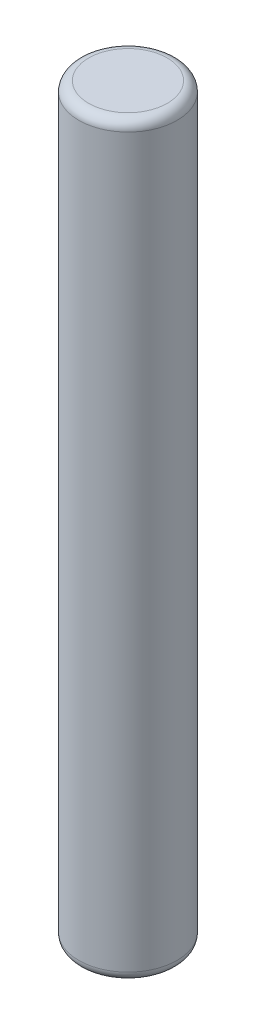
ISO-10303-21;
HEADER;
FILE_DESCRIPTION(('STEP AP214'),'2;1');
FILE_NAME('part.step','',(''),(''),'','','');
FILE_SCHEMA(('AUTOMOTIVE_DESIGN { 1 0 10303 214 1 1 1 1 }'));
ENDSEC;
DATA;
#1=APPLICATION_CONTEXT('core data for automotive mechanical design processes');
#2=APPLICATION_PROTOCOL_DEFINITION('international standard','automotive_design',2000,#1);
#3=PRODUCT_CONTEXT('',#1,'mechanical');
#4=PRODUCT('Part','Part','',(#3));
#5=PRODUCT_RELATED_PRODUCT_CATEGORY('part','',(#4));
#6=PRODUCT_DEFINITION_FORMATION('','',#4);
#7=PRODUCT_DEFINITION_CONTEXT('part definition',#1,'design');
#8=PRODUCT_DEFINITION('design','',#6,#7);
#9=PRODUCT_DEFINITION_SHAPE('','',#8);
#10=(LENGTH_UNIT() NAMED_UNIT(*) SI_UNIT(.MILLI.,.METRE.));
#11=(NAMED_UNIT(*) PLANE_ANGLE_UNIT() SI_UNIT($,.RADIAN.));
#12=(NAMED_UNIT(*) SI_UNIT($,.STERADIAN.) SOLID_ANGLE_UNIT());
#13=UNCERTAINTY_MEASURE_WITH_UNIT(LENGTH_MEASURE(1.E-05),#10,'distance_accuracy_value','');
#14=(GEOMETRIC_REPRESENTATION_CONTEXT(3) GLOBAL_UNCERTAINTY_ASSIGNED_CONTEXT((#13)) GLOBAL_UNIT_ASSIGNED_CONTEXT((#10,
#11,#12)) REPRESENTATION_CONTEXT('',''));
#15=CARTESIAN_POINT('',(0.,0.,0.));
#16=DIRECTION('',(0.,0.,1.));
#17=DIRECTION('',(1.,0.,0.));
#18=AXIS2_PLACEMENT_3D('',#15,#16,#17);
#19=CARTESIAN_POINT('',(0.,9.5,0.));
#20=DIRECTION('',(0.,-1.,0.));
#21=DIRECTION('',(0.,0.,-1.));
#22=AXIS2_PLACEMENT_3D('',#19,#20,#21);
#23=CYLINDRICAL_SURFACE('',#22,1.25);
#24=CARTESIAN_POINT('',(0.,-9.25,0.));
#25=DIRECTION('',(0.,1.,0.));
#26=DIRECTION('',(0.,0.,1.));
#27=AXIS2_PLACEMENT_3D('',#24,#25,#26);
#28=CIRCLE('',#27,1.25);
#29=CARTESIAN_POINT('',(0.,-9.25,1.25));
#30=VERTEX_POINT('',#29);
#31=EDGE_CURVE('E40',#30,#30,#28,.T.);
#32=ORIENTED_EDGE('',*,*,#31,.T.);
#33=EDGE_LOOP('',(#32));
#34=FACE_BOUND('',#33,.T.);
#35=CARTESIAN_POINT('',(0.,9.25,0.));
#36=DIRECTION('',(0.,1.,0.));
#37=DIRECTION('',(0.,0.,1.));
#38=AXIS2_PLACEMENT_3D('',#35,#36,#37);
#39=CIRCLE('',#38,1.25);
#40=CARTESIAN_POINT('',(0.,9.25,1.25));
#41=VERTEX_POINT('',#40);
#42=EDGE_CURVE('E44',#41,#41,#39,.F.);
#43=ORIENTED_EDGE('',*,*,#42,.T.);
#44=EDGE_LOOP('',(#43));
#45=FACE_BOUND('',#44,.T.);
#46=ADVANCED_FACE('F29',(#34,#45),#23,.T.);
#47=CARTESIAN_POINT('',(0.,9.5,0.));
#48=DIRECTION('',(0.,1.,0.));
#49=DIRECTION('',(0.,0.,1.));
#50=AXIS2_PLACEMENT_3D('',#47,#48,#49);
#51=PLANE('',#50);
#52=CARTESIAN_POINT('',(0.,9.5,0.));
#53=DIRECTION('',(0.,1.,0.));
#54=DIRECTION('',(0.,0.,1.));
#55=AXIS2_PLACEMENT_3D('',#52,#53,#54);
#56=CIRCLE('',#55,1.);
#57=CARTESIAN_POINT('',(0.,9.5,1.));
#58=VERTEX_POINT('',#57);
#59=EDGE_CURVE('E10',#58,#58,#56,.T.);
#60=ORIENTED_EDGE('',*,*,#59,.T.);
#61=EDGE_LOOP('',(#60));
#62=FACE_BOUND('',#61,.T.);
#63=ADVANCED_FACE('F60',(#62),#51,.T.);
#64=CARTESIAN_POINT('',(0.,-9.5,0.));
#65=DIRECTION('',(0.,1.,0.));
#66=DIRECTION('',(0.,0.,1.));
#67=AXIS2_PLACEMENT_3D('',#64,#65,#66);
#68=PLANE('',#67);
#69=CARTESIAN_POINT('',(0.,-9.5,0.));
#70=DIRECTION('',(0.,1.,0.));
#71=DIRECTION('',(0.,0.,1.));
#72=AXIS2_PLACEMENT_3D('',#69,#70,#71);
#73=CIRCLE('',#72,1.);
#74=CARTESIAN_POINT('',(0.,-9.5,1.));
#75=VERTEX_POINT('',#74);
#76=EDGE_CURVE('E36',#75,#75,#73,.F.);
#77=ORIENTED_EDGE('',*,*,#76,.T.);
#78=EDGE_LOOP('',(#77));
#79=FACE_BOUND('',#78,.T.);
#80=ADVANCED_FACE('F57',(#79),#68,.F.);
#81=CARTESIAN_POINT('',(0.,-9.25,0.));
#82=DIRECTION('',(0.,1.,0.));
#83=DIRECTION('',(0.,0.,1.));
#84=AXIS2_PLACEMENT_3D('',#81,#82,#83);
#85=TOROIDAL_SURFACE('',#84,1.,0.25);
#86=ORIENTED_EDGE('',*,*,#76,.F.);
#87=EDGE_LOOP('',(#86));
#88=FACE_BOUND('',#87,.T.);
#89=ORIENTED_EDGE('',*,*,#31,.F.);
#90=EDGE_LOOP('',(#89));
#91=FACE_BOUND('',#90,.T.);
#92=ADVANCED_FACE('F53',(#88,#91),#85,.T.);
#93=CARTESIAN_POINT('',(0.,9.25,0.));
#94=DIRECTION('',(0.,1.,0.));
#95=DIRECTION('',(0.,0.,1.));
#96=AXIS2_PLACEMENT_3D('',#93,#94,#95);
#97=TOROIDAL_SURFACE('',#96,1.,0.25);
#98=ORIENTED_EDGE('',*,*,#42,.F.);
#99=EDGE_LOOP('',(#98));
#100=FACE_BOUND('',#99,.T.);
#101=ORIENTED_EDGE('',*,*,#59,.F.);
#102=EDGE_LOOP('',(#101));
#103=FACE_BOUND('',#102,.T.);
#104=ADVANCED_FACE('F31',(#100,#103),#97,.T.);
#105=CLOSED_SHELL('',(#46,#63,#80,#92,#104));
#106=MANIFOLD_SOLID_BREP('B2',#105);
#107=ADVANCED_BREP_SHAPE_REPRESENTATION('',(#18,#106),#14);
#108=SHAPE_DEFINITION_REPRESENTATION(#9,#107);
ENDSEC;
END-ISO-10303-21;
